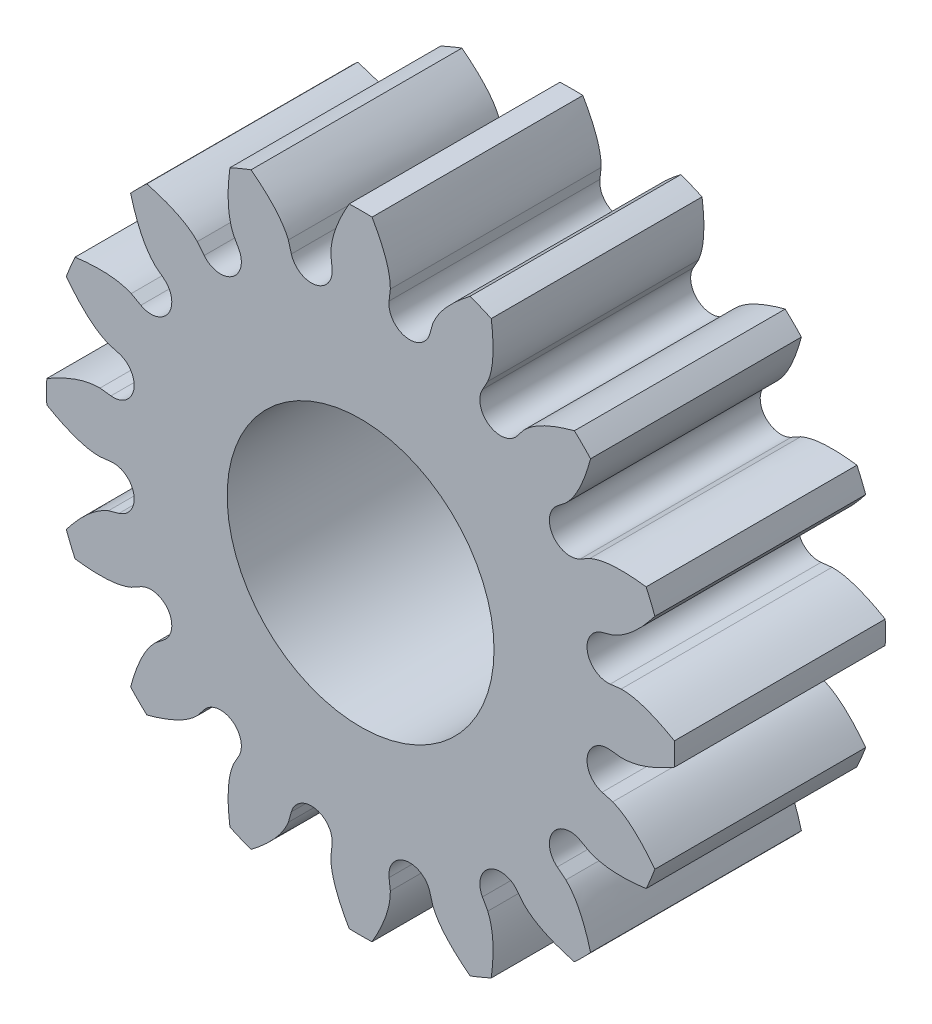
from build123d import *

# Parameters (mm, degrees)
SKETCH3_R                      = 3.302
SKETCH3_R_2                    = 1.905
BASE_DEPTH                     = 3.0099
HALF_TOOTH_DEPTH               = 3.0099
PATTERN_OF_TOOTH_COUNT         = 16
PATTERN_OF_TOOTH_COPY_1_DEPTH  = 3.0099
PATTERN_OF_TOOTH_COPY_2_DEPTH  = 3.0099
PATTERN_OF_TOOTH_COPY_3_DEPTH  = 3.0099
PATTERN_OF_TOOTH_COPY_4_DEPTH  = 3.0099
PATTERN_OF_TOOTH_COPY_5_DEPTH  = 3.0099
PATTERN_OF_TOOTH_COPY_6_DEPTH  = 3.0099
PATTERN_OF_TOOTH_COPY_7_DEPTH  = 3.0099
PATTERN_OF_TOOTH_COPY_8_DEPTH  = 3.0099
PATTERN_OF_TOOTH_COPY_9_DEPTH  = 3.0099
PATTERN_OF_TOOTH_COPY_10_DEPTH = 3.0099
PATTERN_OF_TOOTH_COPY_11_DEPTH = 3.0099
PATTERN_OF_TOOTH_COPY_12_DEPTH = 3.0099
PATTERN_OF_TOOTH_COPY_13_DEPTH = 3.0099
PATTERN_OF_TOOTH_COPY_14_DEPTH = 3.0099
PATTERN_OF_TOOTH_COPY_15_DEPTH = 3.0099


with BuildPart() as part:
    # Sketch3 → Base (new body)
    with BuildSketch(Plane.XY):
        Circle(SKETCH3_R)
        Circle(SKETCH3_R_2, mode=Mode.SUBTRACT)
    extrude(amount=BASE_DEPTH)

    # Sketch2 → Half tooth (add)
    with BuildSketch(Plane.XY):
        with BuildLine():
            Line((0, 4.4831), (0, 3.302))
            ThreePointArc((0, 3.302), (0.323652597, 3.286099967), (0.644188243, 3.238552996))
            ThreePointArc((0.644188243, 3.238552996), (0.461967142, 3.354931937), (0.406719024, 3.563968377))
            Line((0.406719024, 3.563968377), (0.424583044, 3.720505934))
            add(Edge.make_bspline(
                [(0.424583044, 3.720505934), (0.425845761, 3.803383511), (0.380146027, 4.07262239), (0.256625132, 4.316784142), (0.163284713, 4.480125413)],
                knots=[0, 0, 0, 0, 0.305960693, 1, 1, 1, 1], degree=3))
            ThreePointArc((0.163284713, 4.480125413), (0.081655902, 4.482356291), (0, 4.4831))
        make_face()
    half_tooth = extrude(amount=HALF_TOOTH_DEPTH)

    # Mirror of half tooth: Half tooth across plane
    add(half_tooth.mirror(Plane.ZY))

    # Pattern of tooth: Half tooth ×16 about axis
    pattern_of_tooth_axis = Axis((0, 0, 0), (0, 0, -1))
    for i in range(1, PATTERN_OF_TOOTH_COUNT):
        add(half_tooth.rotate(pattern_of_tooth_axis, i * 360 / PATTERN_OF_TOOTH_COUNT))

    # Pattern of tooth copy 1 sketch → Pattern of tooth copy 1 (add)
    with BuildSketch(Plane(origin=(0, 0, 0), x_dir=(-0.9238795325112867, 0.3826834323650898, 0), z_dir=(0, 0, 1))):
        with BuildLine():
            Line((0, -4.4831), (0, -3.302))
            ThreePointArc((0, -3.302), (0.323652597, -3.286099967), (0.644188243, -3.238552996))
            ThreePointArc((0.644188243, -3.238552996), (0.461967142, -3.354931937), (0.406719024, -3.563968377))
            Line((0.406719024, -3.563968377), (0.424583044, -3.720505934))
            add(Edge.make_bspline(
                [(0.424583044, -3.720505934), (0.425845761, -3.803383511), (0.380146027, -4.07262239), (0.256625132, -4.316784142), (0.163284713, -4.480125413)],
                knots=[0, 0, 0, 0, 0.305960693, 1, 1, 1, 1], degree=3))
            ThreePointArc((0.163284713, -4.480125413), (0.081655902, -4.482356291), (0, -4.4831))
        make_face()
    extrude(amount=PATTERN_OF_TOOTH_COPY_1_DEPTH)

    # Pattern of tooth copy 2 sketch → Pattern of tooth copy 2 (add)
    with BuildSketch(Plane(origin=(0, 0, 0), x_dir=(-0.7071067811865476, 0.7071067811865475, 0), z_dir=(0, 0, 1))):
        with BuildLine():
            Line((0, -4.4831), (0, -3.302))
            ThreePointArc((0, -3.302), (0.323652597, -3.286099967), (0.644188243, -3.238552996))
            ThreePointArc((0.644188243, -3.238552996), (0.461967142, -3.354931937), (0.406719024, -3.563968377))
            Line((0.406719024, -3.563968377), (0.424583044, -3.720505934))
            add(Edge.make_bspline(
                [(0.424583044, -3.720505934), (0.425845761, -3.803383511), (0.380146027, -4.07262239), (0.256625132, -4.316784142), (0.163284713, -4.480125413)],
                knots=[0, 0, 0, 0, 0.305960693, 1, 1, 1, 1], degree=3))
            ThreePointArc((0.163284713, -4.480125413), (0.081655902, -4.482356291), (0, -4.4831))
        make_face()
    extrude(amount=PATTERN_OF_TOOTH_COPY_2_DEPTH)

    # Pattern of tooth copy 3 sketch → Pattern of tooth copy 3 (add)
    with BuildSketch(Plane(origin=(0, 0, 0), x_dir=(-0.38268343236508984, 0.9238795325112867, 0), z_dir=(0, 0, 1))):
        with BuildLine():
            Line((0, -4.4831), (0, -3.302))
            ThreePointArc((0, -3.302), (0.323652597, -3.286099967), (0.644188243, -3.238552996))
            ThreePointArc((0.644188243, -3.238552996), (0.461967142, -3.354931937), (0.406719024, -3.563968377))
            Line((0.406719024, -3.563968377), (0.424583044, -3.720505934))
            add(Edge.make_bspline(
                [(0.424583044, -3.720505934), (0.425845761, -3.803383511), (0.380146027, -4.07262239), (0.256625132, -4.316784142), (0.163284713, -4.480125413)],
                knots=[0, 0, 0, 0, 0.305960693, 1, 1, 1, 1], degree=3))
            ThreePointArc((0.163284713, -4.480125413), (0.081655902, -4.482356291), (0, -4.4831))
        make_face()
    extrude(amount=PATTERN_OF_TOOTH_COPY_3_DEPTH)

    # Pattern of tooth copy 4 sketch → Pattern of tooth copy 4 (add)
    with BuildSketch(Plane(origin=(0, 0, 0), x_dir=(0, 1, 0), z_dir=(0, 0, 1))):
        with BuildLine():
            Line((0, -4.4831), (0, -3.302))
            ThreePointArc((0, -3.302), (0.323652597, -3.286099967), (0.644188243, -3.238552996))
            ThreePointArc((0.644188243, -3.238552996), (0.461967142, -3.354931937), (0.406719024, -3.563968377))
            Line((0.406719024, -3.563968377), (0.424583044, -3.720505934))
            add(Edge.make_bspline(
                [(0.424583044, -3.720505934), (0.425845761, -3.803383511), (0.380146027, -4.07262239), (0.256625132, -4.316784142), (0.163284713, -4.480125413)],
                knots=[0, 0, 0, 0, 0.305960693, 1, 1, 1, 1], degree=3))
            ThreePointArc((0.163284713, -4.480125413), (0.081655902, -4.482356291), (0, -4.4831))
        make_face()
    extrude(amount=PATTERN_OF_TOOTH_COPY_4_DEPTH)

    # Pattern of tooth copy 5 sketch → Pattern of tooth copy 5 (add)
    with BuildSketch(Plane(origin=(0, 0, 0), x_dir=(0.3826834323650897, 0.9238795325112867, 0), z_dir=(0, 0, 1))):
        with BuildLine():
            Line((0, -4.4831), (0, -3.302))
            ThreePointArc((0, -3.302), (0.323652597, -3.286099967), (0.644188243, -3.238552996))
            ThreePointArc((0.644188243, -3.238552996), (0.461967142, -3.354931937), (0.406719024, -3.563968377))
            Line((0.406719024, -3.563968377), (0.424583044, -3.720505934))
            add(Edge.make_bspline(
                [(0.424583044, -3.720505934), (0.425845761, -3.803383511), (0.380146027, -4.07262239), (0.256625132, -4.316784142), (0.163284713, -4.480125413)],
                knots=[0, 0, 0, 0, 0.305960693, 1, 1, 1, 1], degree=3))
            ThreePointArc((0.163284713, -4.480125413), (0.081655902, -4.482356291), (0, -4.4831))
        make_face()
    extrude(amount=PATTERN_OF_TOOTH_COPY_5_DEPTH)

    # Pattern of tooth copy 6 sketch → Pattern of tooth copy 6 (add)
    with BuildSketch(Plane(origin=(0, 0, 0), x_dir=(0.7071067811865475, 0.7071067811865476, 0), z_dir=(0, 0, 1))):
        with BuildLine():
            Line((0, -4.4831), (0, -3.302))
            ThreePointArc((0, -3.302), (0.323652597, -3.286099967), (0.644188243, -3.238552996))
            ThreePointArc((0.644188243, -3.238552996), (0.461967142, -3.354931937), (0.406719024, -3.563968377))
            Line((0.406719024, -3.563968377), (0.424583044, -3.720505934))
            add(Edge.make_bspline(
                [(0.424583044, -3.720505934), (0.425845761, -3.803383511), (0.380146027, -4.07262239), (0.256625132, -4.316784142), (0.163284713, -4.480125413)],
                knots=[0, 0, 0, 0, 0.305960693, 1, 1, 1, 1], degree=3))
            ThreePointArc((0.163284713, -4.480125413), (0.081655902, -4.482356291), (0, -4.4831))
        make_face()
    extrude(amount=PATTERN_OF_TOOTH_COPY_6_DEPTH)

    # Pattern of tooth copy 7 sketch → Pattern of tooth copy 7 (add)
    with BuildSketch(Plane(origin=(0, 0, 0), x_dir=(0.9238795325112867, 0.3826834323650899, 0), z_dir=(0, 0, 1))):
        with BuildLine():
            Line((0, -4.4831), (0, -3.302))
            ThreePointArc((0, -3.302), (0.323652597, -3.286099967), (0.644188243, -3.238552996))
            ThreePointArc((0.644188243, -3.238552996), (0.461967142, -3.354931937), (0.406719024, -3.563968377))
            Line((0.406719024, -3.563968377), (0.424583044, -3.720505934))
            add(Edge.make_bspline(
                [(0.424583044, -3.720505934), (0.425845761, -3.803383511), (0.380146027, -4.07262239), (0.256625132, -4.316784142), (0.163284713, -4.480125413)],
                knots=[0, 0, 0, 0, 0.305960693, 1, 1, 1, 1], degree=3))
            ThreePointArc((0.163284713, -4.480125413), (0.081655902, -4.482356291), (0, -4.4831))
        make_face()
    extrude(amount=PATTERN_OF_TOOTH_COPY_7_DEPTH)

    # Pattern of tooth copy 8 sketch → Pattern of tooth copy 8 (add)
    with BuildSketch(Plane.XY):
        with BuildLine():
            Line((0, -4.4831), (0, -3.302))
            ThreePointArc((0, -3.302), (0.323652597, -3.286099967), (0.644188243, -3.238552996))
            ThreePointArc((0.644188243, -3.238552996), (0.461967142, -3.354931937), (0.406719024, -3.563968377))
            Line((0.406719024, -3.563968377), (0.424583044, -3.720505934))
            add(Edge.make_bspline(
                [(0.424583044, -3.720505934), (0.425845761, -3.803383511), (0.380146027, -4.07262239), (0.256625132, -4.316784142), (0.163284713, -4.480125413)],
                knots=[0, 0, 0, 0, 0.305960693, 1, 1, 1, 1], degree=3))
            ThreePointArc((0.163284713, -4.480125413), (0.081655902, -4.482356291), (0, -4.4831))
        make_face()
    extrude(amount=PATTERN_OF_TOOTH_COPY_8_DEPTH)

    # Pattern of tooth copy 9 sketch → Pattern of tooth copy 9 (add)
    with BuildSketch(Plane(origin=(0, 0, 0), x_dir=(0.9238795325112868, -0.38268343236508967, 0), z_dir=(0, 0, 1))):
        with BuildLine():
            Line((0, -4.4831), (0, -3.302))
            ThreePointArc((0, -3.302), (0.323652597, -3.286099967), (0.644188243, -3.238552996))
            ThreePointArc((0.644188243, -3.238552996), (0.461967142, -3.354931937), (0.406719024, -3.563968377))
            Line((0.406719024, -3.563968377), (0.424583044, -3.720505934))
            add(Edge.make_bspline(
                [(0.424583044, -3.720505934), (0.425845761, -3.803383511), (0.380146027, -4.07262239), (0.256625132, -4.316784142), (0.163284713, -4.480125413)],
                knots=[0, 0, 0, 0, 0.305960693, 1, 1, 1, 1], degree=3))
            ThreePointArc((0.163284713, -4.480125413), (0.081655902, -4.482356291), (0, -4.4831))
        make_face()
    extrude(amount=PATTERN_OF_TOOTH_COPY_9_DEPTH)

    # Pattern of tooth copy 10 sketch → Pattern of tooth copy 10 (add)
    with BuildSketch(Plane(origin=(0, 0, 0), x_dir=(0.7071067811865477, -0.7071067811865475, 0), z_dir=(0, 0, 1))):
        with BuildLine():
            Line((0, -4.4831), (0, -3.302))
            ThreePointArc((0, -3.302), (0.323652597, -3.286099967), (0.644188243, -3.238552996))
            ThreePointArc((0.644188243, -3.238552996), (0.461967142, -3.354931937), (0.406719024, -3.563968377))
            Line((0.406719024, -3.563968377), (0.424583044, -3.720505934))
            add(Edge.make_bspline(
                [(0.424583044, -3.720505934), (0.425845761, -3.803383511), (0.380146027, -4.07262239), (0.256625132, -4.316784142), (0.163284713, -4.480125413)],
                knots=[0, 0, 0, 0, 0.305960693, 1, 1, 1, 1], degree=3))
            ThreePointArc((0.163284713, -4.480125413), (0.081655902, -4.482356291), (0, -4.4831))
        make_face()
    extrude(amount=PATTERN_OF_TOOTH_COPY_10_DEPTH)

    # Pattern of tooth copy 11 sketch → Pattern of tooth copy 11 (add)
    with BuildSketch(Plane(origin=(0, 0, 0), x_dir=(0.3826834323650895, -0.9238795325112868, 0), z_dir=(0, 0, 1))):
        with BuildLine():
            Line((0, -4.4831), (0, -3.302))
            ThreePointArc((0, -3.302), (0.323652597, -3.286099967), (0.644188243, -3.238552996))
            ThreePointArc((0.644188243, -3.238552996), (0.461967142, -3.354931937), (0.406719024, -3.563968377))
            Line((0.406719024, -3.563968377), (0.424583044, -3.720505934))
            add(Edge.make_bspline(
                [(0.424583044, -3.720505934), (0.425845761, -3.803383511), (0.380146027, -4.07262239), (0.256625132, -4.316784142), (0.163284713, -4.480125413)],
                knots=[0, 0, 0, 0, 0.305960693, 1, 1, 1, 1], degree=3))
            ThreePointArc((0.163284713, -4.480125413), (0.081655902, -4.482356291), (0, -4.4831))
        make_face()
    extrude(amount=PATTERN_OF_TOOTH_COPY_11_DEPTH)

    # Pattern of tooth copy 12 sketch → Pattern of tooth copy 12 (add)
    with BuildSketch(Plane(origin=(0, 0, 0), x_dir=(0, -1, 0), z_dir=(0, 0, 1))):
        with BuildLine():
            Line((0, -4.4831), (0, -3.302))
            ThreePointArc((0, -3.302), (0.323652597, -3.286099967), (0.644188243, -3.238552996))
            ThreePointArc((0.644188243, -3.238552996), (0.461967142, -3.354931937), (0.406719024, -3.563968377))
            Line((0.406719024, -3.563968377), (0.424583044, -3.720505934))
            add(Edge.make_bspline(
                [(0.424583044, -3.720505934), (0.425845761, -3.803383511), (0.380146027, -4.07262239), (0.256625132, -4.316784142), (0.163284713, -4.480125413)],
                knots=[0, 0, 0, 0, 0.305960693, 1, 1, 1, 1], degree=3))
            ThreePointArc((0.163284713, -4.480125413), (0.081655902, -4.482356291), (0, -4.4831))
        make_face()
    extrude(amount=PATTERN_OF_TOOTH_COPY_12_DEPTH)

    # Pattern of tooth copy 13 sketch → Pattern of tooth copy 13 (add)
    with BuildSketch(Plane(origin=(0, 0, 0), x_dir=(-0.38268343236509, -0.9238795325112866, 0), z_dir=(0, 0, 1))):
        with BuildLine():
            Line((0, -4.4831), (0, -3.302))
            ThreePointArc((0, -3.302), (0.323652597, -3.286099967), (0.644188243, -3.238552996))
            ThreePointArc((0.644188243, -3.238552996), (0.461967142, -3.354931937), (0.406719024, -3.563968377))
            Line((0.406719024, -3.563968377), (0.424583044, -3.720505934))
            add(Edge.make_bspline(
                [(0.424583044, -3.720505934), (0.425845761, -3.803383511), (0.380146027, -4.07262239), (0.256625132, -4.316784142), (0.163284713, -4.480125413)],
                knots=[0, 0, 0, 0, 0.305960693, 1, 1, 1, 1], degree=3))
            ThreePointArc((0.163284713, -4.480125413), (0.081655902, -4.482356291), (0, -4.4831))
        make_face()
    extrude(amount=PATTERN_OF_TOOTH_COPY_13_DEPTH)

    # Pattern of tooth copy 14 sketch → Pattern of tooth copy 14 (add)
    with BuildSketch(Plane(origin=(0, 0, 0), x_dir=(-0.7071067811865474, -0.7071067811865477, 0), z_dir=(0, 0, 1))):
        with BuildLine():
            Line((0, -4.4831), (0, -3.302))
            ThreePointArc((0, -3.302), (0.323652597, -3.286099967), (0.644188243, -3.238552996))
            ThreePointArc((0.644188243, -3.238552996), (0.461967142, -3.354931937), (0.406719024, -3.563968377))
            Line((0.406719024, -3.563968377), (0.424583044, -3.720505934))
            add(Edge.make_bspline(
                [(0.424583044, -3.720505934), (0.425845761, -3.803383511), (0.380146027, -4.07262239), (0.256625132, -4.316784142), (0.163284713, -4.480125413)],
                knots=[0, 0, 0, 0, 0.305960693, 1, 1, 1, 1], degree=3))
            ThreePointArc((0.163284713, -4.480125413), (0.081655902, -4.482356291), (0, -4.4831))
        make_face()
    extrude(amount=PATTERN_OF_TOOTH_COPY_14_DEPTH)

    # Pattern of tooth copy 15 sketch → Pattern of tooth copy 15 (add)
    with BuildSketch(Plane(origin=(0, 0, 0), x_dir=(-0.9238795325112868, -0.38268343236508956, 0), z_dir=(0, 0, 1))):
        with BuildLine():
            Line((0, -4.4831), (0, -3.302))
            ThreePointArc((0, -3.302), (0.323652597, -3.286099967), (0.644188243, -3.238552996))
            ThreePointArc((0.644188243, -3.238552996), (0.461967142, -3.354931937), (0.406719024, -3.563968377))
            Line((0.406719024, -3.563968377), (0.424583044, -3.720505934))
            add(Edge.make_bspline(
                [(0.424583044, -3.720505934), (0.425845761, -3.803383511), (0.380146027, -4.07262239), (0.256625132, -4.316784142), (0.163284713, -4.480125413)],
                knots=[0, 0, 0, 0, 0.305960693, 1, 1, 1, 1], degree=3))
            ThreePointArc((0.163284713, -4.480125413), (0.081655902, -4.482356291), (0, -4.4831))
        make_face()
    extrude(amount=PATTERN_OF_TOOTH_COPY_15_DEPTH)


solid = part.part
